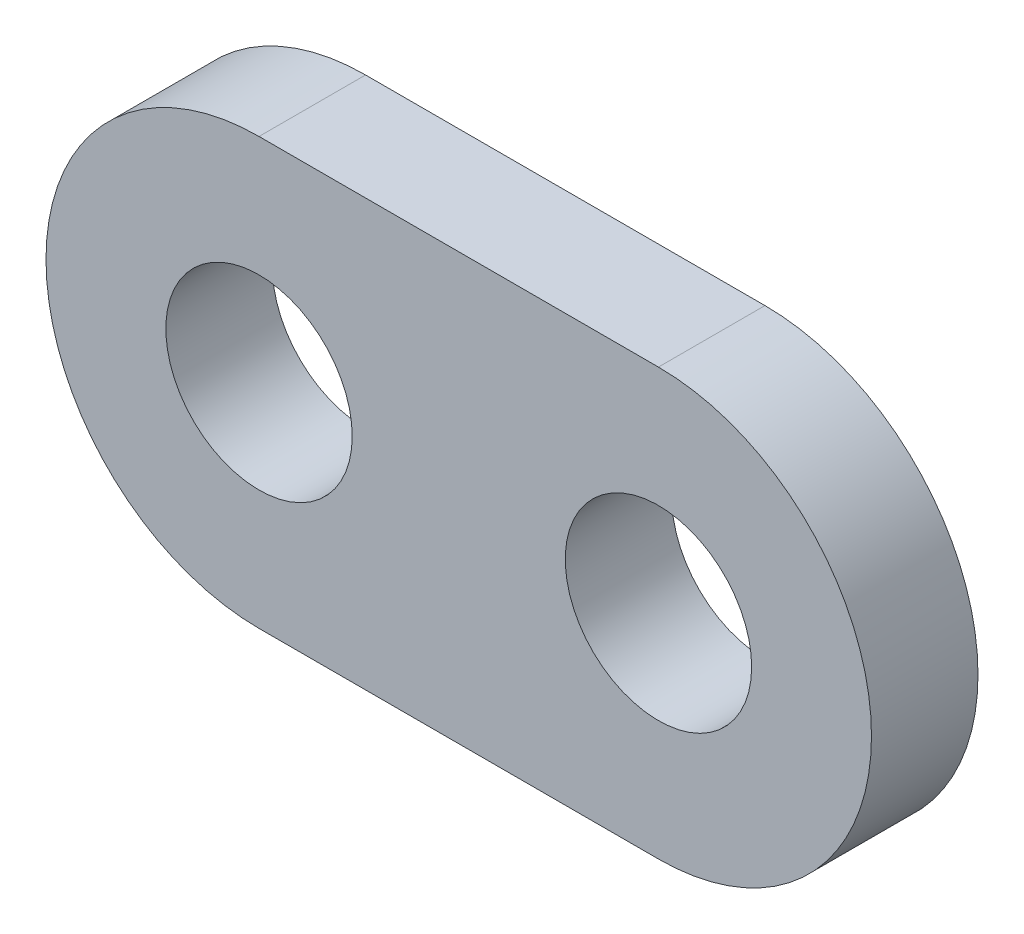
ISO-10303-21;
HEADER;
FILE_DESCRIPTION(('STEP AP214'),'2;1');
FILE_NAME('part.step','',(''),(''),'','','');
FILE_SCHEMA(('AUTOMOTIVE_DESIGN { 1 0 10303 214 1 1 1 1 }'));
ENDSEC;
DATA;
#1=APPLICATION_CONTEXT('core data for automotive mechanical design processes');
#2=APPLICATION_PROTOCOL_DEFINITION('international standard','automotive_design',2000,#1);
#3=PRODUCT_CONTEXT('',#1,'mechanical');
#4=PRODUCT('Part','Part','',(#3));
#5=PRODUCT_RELATED_PRODUCT_CATEGORY('part','',(#4));
#6=PRODUCT_DEFINITION_FORMATION('','',#4);
#7=PRODUCT_DEFINITION_CONTEXT('part definition',#1,'design');
#8=PRODUCT_DEFINITION('design','',#6,#7);
#9=PRODUCT_DEFINITION_SHAPE('','',#8);
#10=(LENGTH_UNIT() NAMED_UNIT(*) SI_UNIT(.MILLI.,.METRE.));
#11=(NAMED_UNIT(*) PLANE_ANGLE_UNIT() SI_UNIT($,.RADIAN.));
#12=(NAMED_UNIT(*) SI_UNIT($,.STERADIAN.) SOLID_ANGLE_UNIT());
#13=UNCERTAINTY_MEASURE_WITH_UNIT(LENGTH_MEASURE(1.E-05),#10,'distance_accuracy_value','');
#14=(GEOMETRIC_REPRESENTATION_CONTEXT(3) GLOBAL_UNCERTAINTY_ASSIGNED_CONTEXT((#13)) GLOBAL_UNIT_ASSIGNED_CONTEXT((#10,
#11,#12)) REPRESENTATION_CONTEXT('',''));
#15=CARTESIAN_POINT('',(0.,0.,0.));
#16=DIRECTION('',(0.,0.,1.));
#17=DIRECTION('',(1.,0.,0.));
#18=AXIS2_PLACEMENT_3D('',#15,#16,#17);
#19=CARTESIAN_POINT('',(0.,40.,20.));
#20=DIRECTION('',(0.,0.,1.));
#21=DIRECTION('',(1.,0.,0.));
#22=AXIS2_PLACEMENT_3D('',#19,#20,#21);
#23=PLANE('',#22);
#24=CARTESIAN_POINT('',(0.,40.,20.));
#25=DIRECTION('',(0.,0.,1.));
#26=DIRECTION('',(1.,0.,0.));
#27=AXIS2_PLACEMENT_3D('',#24,#25,#26);
#28=CIRCLE('',#27,17.5);
#29=CARTESIAN_POINT('',(17.5,40.,20.));
#30=VERTEX_POINT('',#29);
#31=EDGE_CURVE('E92',#30,#30,#28,.T.);
#32=ORIENTED_EDGE('',*,*,#31,.F.);
#33=EDGE_LOOP('',(#32));
#34=FACE_BOUND('',#33,.T.);
#35=CARTESIAN_POINT('',(0.,40.,20.));
#36=DIRECTION('',(0.,0.,1.));
#37=DIRECTION('',(1.,0.,0.));
#38=AXIS2_PLACEMENT_3D('',#35,#36,#37);
#39=CIRCLE('',#38,40.);
#40=CARTESIAN_POINT('',(0.,80.,20.));
#41=VERTEX_POINT('',#40);
#42=CARTESIAN_POINT('',(0.,0.,20.));
#43=VERTEX_POINT('',#42);
#44=EDGE_CURVE('E102',#41,#43,#39,.T.);
#45=ORIENTED_EDGE('',*,*,#44,.T.);
#46=DIRECTION('',(1.,0.,0.));
#47=VECTOR('',#46,1.);
#48=CARTESIAN_POINT('',(0.,0.,20.));
#49=LINE('',#48,#47);
#50=CARTESIAN_POINT('',(75.,0.,20.));
#51=VERTEX_POINT('',#50);
#52=EDGE_CURVE('E87',#43,#51,#49,.T.);
#53=ORIENTED_EDGE('',*,*,#52,.T.);
#54=CARTESIAN_POINT('',(75.,40.,20.));
#55=DIRECTION('',(0.,0.,1.));
#56=DIRECTION('',(1.,0.,0.));
#57=AXIS2_PLACEMENT_3D('',#54,#55,#56);
#58=CIRCLE('',#57,40.);
#59=CARTESIAN_POINT('',(75.,80.,20.));
#60=VERTEX_POINT('',#59);
#61=EDGE_CURVE('E53',#51,#60,#58,.T.);
#62=ORIENTED_EDGE('',*,*,#61,.T.);
#63=DIRECTION('',(-1.,0.,0.));
#64=VECTOR('',#63,1.);
#65=CARTESIAN_POINT('',(75.,80.,20.));
#66=LINE('',#65,#64);
#67=EDGE_CURVE('E48',#60,#41,#66,.T.);
#68=ORIENTED_EDGE('',*,*,#67,.T.);
#69=EDGE_LOOP('',(#45,#53,#62,#68));
#70=FACE_BOUND('',#69,.T.);
#71=CARTESIAN_POINT('',(75.,40.,20.));
#72=DIRECTION('',(0.,0.,1.));
#73=DIRECTION('',(1.,0.,0.));
#74=AXIS2_PLACEMENT_3D('',#71,#72,#73);
#75=CIRCLE('',#74,17.5);
#76=CARTESIAN_POINT('',(92.5,40.,20.));
#77=VERTEX_POINT('',#76);
#78=EDGE_CURVE('E120',#77,#77,#75,.T.);
#79=ORIENTED_EDGE('',*,*,#78,.F.);
#80=EDGE_LOOP('',(#79));
#81=FACE_BOUND('',#80,.T.);
#82=ADVANCED_FACE('F33',(#34,#70,#81),#23,.T.);
#83=CARTESIAN_POINT('',(0.,40.,0.));
#84=DIRECTION('',(0.,0.,1.));
#85=DIRECTION('',(1.,0.,0.));
#86=AXIS2_PLACEMENT_3D('',#83,#84,#85);
#87=PLANE('',#86);
#88=CARTESIAN_POINT('',(0.,40.,0.));
#89=DIRECTION('',(0.,0.,1.));
#90=DIRECTION('',(1.,0.,0.));
#91=AXIS2_PLACEMENT_3D('',#88,#89,#90);
#92=CIRCLE('',#91,17.5);
#93=CARTESIAN_POINT('',(17.5,40.,0.));
#94=VERTEX_POINT('',#93);
#95=EDGE_CURVE('E95',#94,#94,#92,.T.);
#96=ORIENTED_EDGE('',*,*,#95,.T.);
#97=EDGE_LOOP('',(#96));
#98=FACE_BOUND('',#97,.T.);
#99=CARTESIAN_POINT('',(0.,40.,0.));
#100=DIRECTION('',(0.,0.,1.));
#101=DIRECTION('',(1.,0.,0.));
#102=AXIS2_PLACEMENT_3D('',#99,#100,#101);
#103=CIRCLE('',#102,40.);
#104=CARTESIAN_POINT('',(0.,80.,0.));
#105=VERTEX_POINT('',#104);
#106=CARTESIAN_POINT('',(0.,0.,0.));
#107=VERTEX_POINT('',#106);
#108=EDGE_CURVE('E79',#105,#107,#103,.T.);
#109=ORIENTED_EDGE('',*,*,#108,.F.);
#110=DIRECTION('',(-1.,0.,0.));
#111=VECTOR('',#110,1.);
#112=CARTESIAN_POINT('',(75.,80.,0.));
#113=LINE('',#112,#111);
#114=CARTESIAN_POINT('',(75.,80.,0.));
#115=VERTEX_POINT('',#114);
#116=EDGE_CURVE('E100',#115,#105,#113,.T.);
#117=ORIENTED_EDGE('',*,*,#116,.F.);
#118=CARTESIAN_POINT('',(75.,40.,0.));
#119=DIRECTION('',(0.,0.,1.));
#120=DIRECTION('',(1.,0.,0.));
#121=AXIS2_PLACEMENT_3D('',#118,#119,#120);
#122=CIRCLE('',#121,40.);
#123=CARTESIAN_POINT('',(75.,0.,0.));
#124=VERTEX_POINT('',#123);
#125=EDGE_CURVE('E80',#124,#115,#122,.T.);
#126=ORIENTED_EDGE('',*,*,#125,.F.);
#127=DIRECTION('',(1.,0.,0.));
#128=VECTOR('',#127,1.);
#129=CARTESIAN_POINT('',(0.,0.,0.));
#130=LINE('',#129,#128);
#131=EDGE_CURVE('E74',#107,#124,#130,.T.);
#132=ORIENTED_EDGE('',*,*,#131,.F.);
#133=EDGE_LOOP('',(#109,#117,#126,#132));
#134=FACE_BOUND('',#133,.T.);
#135=CARTESIAN_POINT('',(75.,40.,0.));
#136=DIRECTION('',(0.,0.,1.));
#137=DIRECTION('',(1.,0.,0.));
#138=AXIS2_PLACEMENT_3D('',#135,#136,#137);
#139=CIRCLE('',#138,17.5);
#140=CARTESIAN_POINT('',(92.5,40.,0.));
#141=VERTEX_POINT('',#140);
#142=EDGE_CURVE('E122',#141,#141,#139,.T.);
#143=ORIENTED_EDGE('',*,*,#142,.T.);
#144=EDGE_LOOP('',(#143));
#145=FACE_BOUND('',#144,.T.);
#146=ADVANCED_FACE('F75',(#98,#134,#145),#87,.F.);
#147=CARTESIAN_POINT('',(0.,40.,20.));
#148=DIRECTION('',(0.,0.,-1.));
#149=DIRECTION('',(-1.,0.,0.));
#150=AXIS2_PLACEMENT_3D('',#147,#148,#149);
#151=CYLINDRICAL_SURFACE('',#150,40.);
#152=ORIENTED_EDGE('',*,*,#108,.T.);
#153=DIRECTION('',(0.,0.,-1.));
#154=VECTOR('',#153,1.);
#155=CARTESIAN_POINT('',(0.,0.,20.));
#156=LINE('',#155,#154);
#157=EDGE_CURVE('E11',#43,#107,#156,.T.);
#158=ORIENTED_EDGE('',*,*,#157,.F.);
#159=ORIENTED_EDGE('',*,*,#44,.F.);
#160=DIRECTION('',(0.,0.,-1.));
#161=VECTOR('',#160,1.);
#162=CARTESIAN_POINT('',(0.,80.,20.));
#163=LINE('',#162,#161);
#164=EDGE_CURVE('E91',#41,#105,#163,.T.);
#165=ORIENTED_EDGE('',*,*,#164,.T.);
#166=EDGE_LOOP('',(#152,#158,#159,#165));
#167=FACE_BOUND('',#166,.T.);
#168=ADVANCED_FACE('F35',(#167),#151,.T.);
#169=CARTESIAN_POINT('',(0.,0.,20.));
#170=DIRECTION('',(0.,1.,0.));
#171=DIRECTION('',(0.,0.,1.));
#172=AXIS2_PLACEMENT_3D('',#169,#170,#171);
#173=PLANE('',#172);
#174=ORIENTED_EDGE('',*,*,#131,.T.);
#175=DIRECTION('',(0.,0.,-1.));
#176=VECTOR('',#175,1.);
#177=CARTESIAN_POINT('',(75.,0.,20.));
#178=LINE('',#177,#176);
#179=EDGE_CURVE('E41',#51,#124,#178,.T.);
#180=ORIENTED_EDGE('',*,*,#179,.F.);
#181=ORIENTED_EDGE('',*,*,#52,.F.);
#182=ORIENTED_EDGE('',*,*,#157,.T.);
#183=EDGE_LOOP('',(#174,#180,#181,#182));
#184=FACE_BOUND('',#183,.T.);
#185=ADVANCED_FACE('F86',(#184),#173,.F.);
#186=CARTESIAN_POINT('',(75.,40.,20.));
#187=DIRECTION('',(0.,0.,-1.));
#188=DIRECTION('',(-1.,0.,0.));
#189=AXIS2_PLACEMENT_3D('',#186,#187,#188);
#190=CYLINDRICAL_SURFACE('',#189,40.);
#191=ORIENTED_EDGE('',*,*,#125,.T.);
#192=DIRECTION('',(0.,0.,-1.));
#193=VECTOR('',#192,1.);
#194=CARTESIAN_POINT('',(75.,80.,20.));
#195=LINE('',#194,#193);
#196=EDGE_CURVE('E108',#60,#115,#195,.T.);
#197=ORIENTED_EDGE('',*,*,#196,.F.);
#198=ORIENTED_EDGE('',*,*,#61,.F.);
#199=ORIENTED_EDGE('',*,*,#179,.T.);
#200=EDGE_LOOP('',(#191,#197,#198,#199));
#201=FACE_BOUND('',#200,.T.);
#202=ADVANCED_FACE('F111',(#201),#190,.T.);
#203=CARTESIAN_POINT('',(75.,80.,20.));
#204=DIRECTION('',(0.,-1.,0.));
#205=DIRECTION('',(1.,0.,0.));
#206=AXIS2_PLACEMENT_3D('',#203,#204,#205);
#207=PLANE('',#206);
#208=ORIENTED_EDGE('',*,*,#116,.T.);
#209=ORIENTED_EDGE('',*,*,#164,.F.);
#210=ORIENTED_EDGE('',*,*,#67,.F.);
#211=ORIENTED_EDGE('',*,*,#196,.T.);
#212=EDGE_LOOP('',(#208,#209,#210,#211));
#213=FACE_BOUND('',#212,.T.);
#214=ADVANCED_FACE('F113',(#213),#207,.F.);
#215=CARTESIAN_POINT('',(0.,40.,20.));
#216=DIRECTION('',(0.,0.,-1.));
#217=DIRECTION('',(-1.,0.,0.));
#218=AXIS2_PLACEMENT_3D('',#215,#216,#217);
#219=CYLINDRICAL_SURFACE('',#218,17.5);
#220=ORIENTED_EDGE('',*,*,#31,.T.);
#221=EDGE_LOOP('',(#220));
#222=FACE_BOUND('',#221,.T.);
#223=ORIENTED_EDGE('',*,*,#95,.F.);
#224=EDGE_LOOP('',(#223));
#225=FACE_BOUND('',#224,.T.);
#226=ADVANCED_FACE('F131',(#222,#225),#219,.F.);
#227=CARTESIAN_POINT('',(75.,40.,20.));
#228=DIRECTION('',(0.,0.,-1.));
#229=DIRECTION('',(-1.,0.,0.));
#230=AXIS2_PLACEMENT_3D('',#227,#228,#229);
#231=CYLINDRICAL_SURFACE('',#230,17.5);
#232=ORIENTED_EDGE('',*,*,#78,.T.);
#233=EDGE_LOOP('',(#232));
#234=FACE_BOUND('',#233,.T.);
#235=ORIENTED_EDGE('',*,*,#142,.F.);
#236=EDGE_LOOP('',(#235));
#237=FACE_BOUND('',#236,.T.);
#238=ADVANCED_FACE('F129',(#234,#237),#231,.F.);
#239=CLOSED_SHELL('',(#82,#146,#168,#185,#202,#214,#226,#238));
#240=MANIFOLD_SOLID_BREP('B2',#239);
#241=ADVANCED_BREP_SHAPE_REPRESENTATION('',(#18,#240),#14);
#242=SHAPE_DEFINITION_REPRESENTATION(#9,#241);
ENDSEC;
END-ISO-10303-21;
